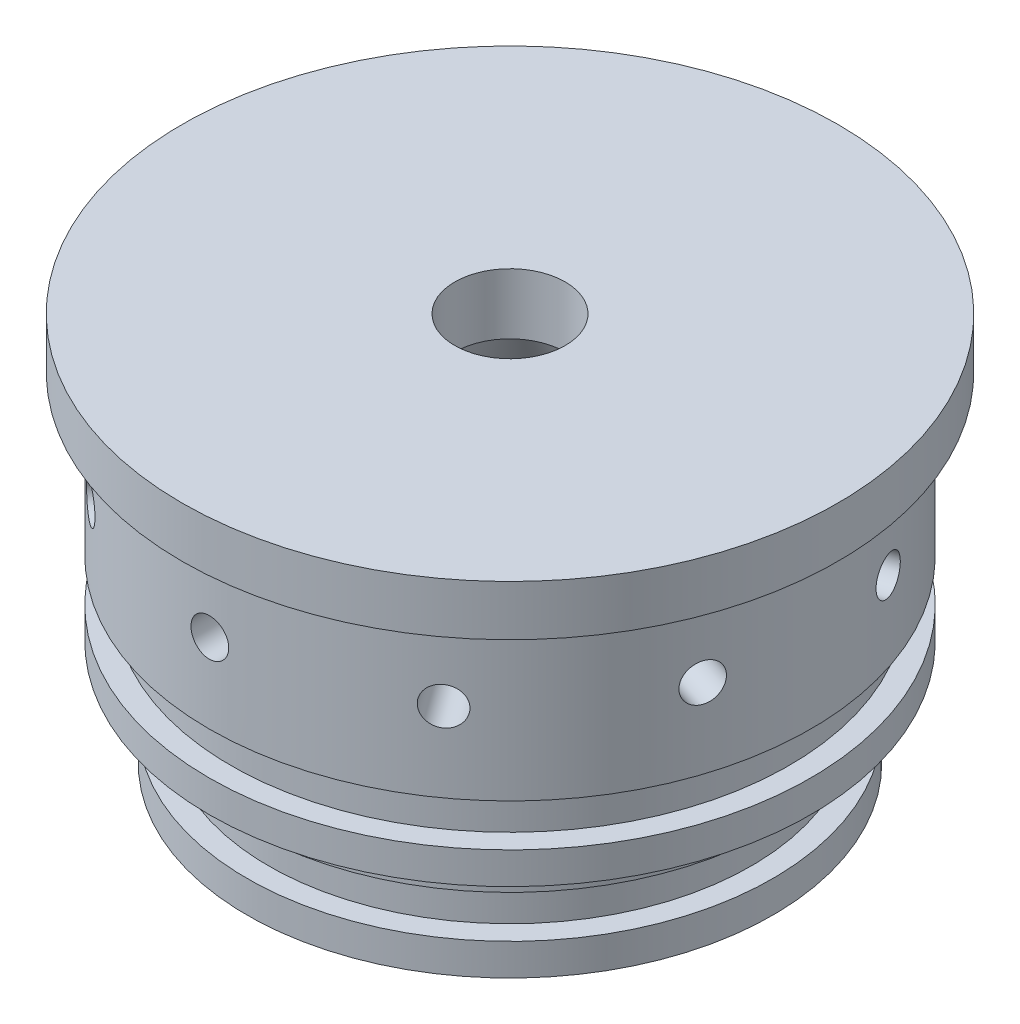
from build123d import *

# Parameters (mm, degrees)
SKETCH3_R          = 2.3749
CUT_EXTRUDE2_DEPTH = 12.7
CIRPATTERN1_COUNT  = 10


with BuildPart() as part:
    # Sketch1 → Revolve1 (revolve)
    with BuildSketch(Plane.XY, mode=Mode.PRIVATE) as revolve1_sk:
        Polygon((6.9453125, 49.01796), (6.9453125, 41.375349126), (20.3835, 12.7), (26.7335, 12.7), (26.7335, 0), (33.0835, 0), (33.0835, 4), (30.3657, 4), (30.3657, 9.334), (33.0835, 9.334), (33.0835, 13.334), (37.846, 13.334), (37.846, 17.334), (35.1282, 17.334), (35.1282, 22.668), (37.846, 22.668), (37.846, 42.66796), (41.275, 42.66796), (41.275, 49.01796), align=None)
    revolve(revolve1_sk.sketch.rotate(Axis((0, 0, 0), (0, 1, 0)), 90), axis=Axis((0, 0, 0), (0, 1, 0)))

    # Sketch3 → Cut-Extrude2 (cut)
    with BuildSketch(Plane.XY.offset(37.846)):
        with Locations((0, 32.66798)):
            Circle(SKETCH3_R)
    cut_extrude2 = extrude(amount=-CUT_EXTRUDE2_DEPTH, mode=Mode.SUBTRACT)

    # CirPattern1: Cut-Extrude2 ×10 about axis
    cirpattern1_axis = Axis((0, 0, 0), (0, 1, 0))
    for i in range(1, CIRPATTERN1_COUNT):
        add(cut_extrude2.rotate(cirpattern1_axis, i * 360 / CIRPATTERN1_COUNT), mode=Mode.SUBTRACT)


solid = part.part
